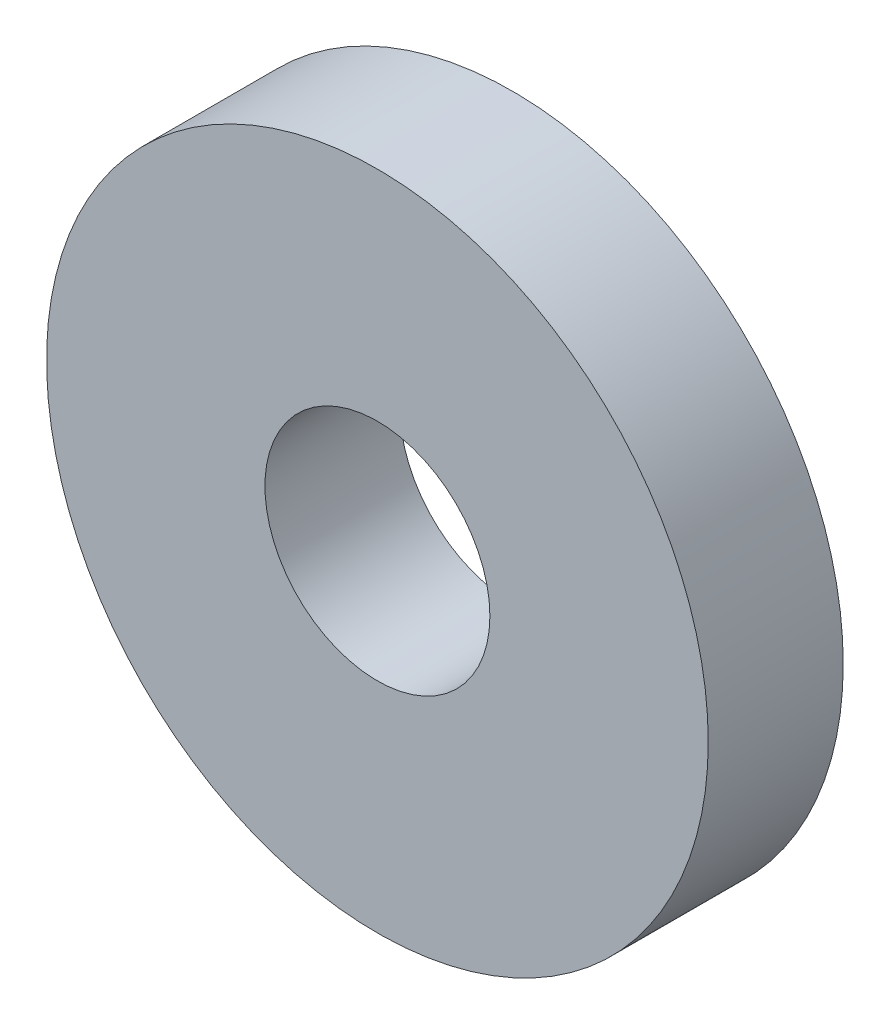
ISO-10303-21;
HEADER;
FILE_DESCRIPTION(('STEP AP214'),'2;1');
FILE_NAME('part.step','',(''),(''),'','','');
FILE_SCHEMA(('AUTOMOTIVE_DESIGN { 1 0 10303 214 1 1 1 1 }'));
ENDSEC;
DATA;
#1=APPLICATION_CONTEXT('core data for automotive mechanical design processes');
#2=APPLICATION_PROTOCOL_DEFINITION('international standard','automotive_design',2000,#1);
#3=PRODUCT_CONTEXT('',#1,'mechanical');
#4=PRODUCT('Part','Part','',(#3));
#5=PRODUCT_RELATED_PRODUCT_CATEGORY('part','',(#4));
#6=PRODUCT_DEFINITION_FORMATION('','',#4);
#7=PRODUCT_DEFINITION_CONTEXT('part definition',#1,'design');
#8=PRODUCT_DEFINITION('design','',#6,#7);
#9=PRODUCT_DEFINITION_SHAPE('','',#8);
#10=(LENGTH_UNIT() NAMED_UNIT(*) SI_UNIT(.MILLI.,.METRE.));
#11=(NAMED_UNIT(*) PLANE_ANGLE_UNIT() SI_UNIT($,.RADIAN.));
#12=(NAMED_UNIT(*) SI_UNIT($,.STERADIAN.) SOLID_ANGLE_UNIT());
#13=UNCERTAINTY_MEASURE_WITH_UNIT(LENGTH_MEASURE(1.E-05),#10,'distance_accuracy_value','');
#14=(GEOMETRIC_REPRESENTATION_CONTEXT(3) GLOBAL_UNCERTAINTY_ASSIGNED_CONTEXT((#13)) GLOBAL_UNIT_ASSIGNED_CONTEXT((#10,
#11,#12)) REPRESENTATION_CONTEXT('',''));
#15=CARTESIAN_POINT('',(0.,0.,0.));
#16=DIRECTION('',(0.,0.,1.));
#17=DIRECTION('',(1.,0.,0.));
#18=AXIS2_PLACEMENT_3D('',#15,#16,#17);
#19=CARTESIAN_POINT('',(0.,0.,5.1));
#20=DIRECTION('',(0.,0.,-1.));
#21=DIRECTION('',(-1.,0.,0.));
#22=AXIS2_PLACEMENT_3D('',#19,#20,#21);
#23=CYLINDRICAL_SURFACE('',#22,4.25);
#24=CARTESIAN_POINT('',(0.,0.,5.1));
#25=DIRECTION('',(0.,0.,1.));
#26=DIRECTION('',(1.,0.,0.));
#27=AXIS2_PLACEMENT_3D('',#24,#25,#26);
#28=CIRCLE('',#27,4.25);
#29=CARTESIAN_POINT('',(4.25,0.,5.1));
#30=VERTEX_POINT('',#29);
#31=EDGE_CURVE('E42',#30,#30,#28,.T.);
#32=ORIENTED_EDGE('',*,*,#31,.T.);
#33=EDGE_LOOP('',(#32));
#34=FACE_BOUND('',#33,.T.);
#35=CARTESIAN_POINT('',(0.,0.,0.));
#36=DIRECTION('',(0.,0.,1.));
#37=DIRECTION('',(1.,0.,0.));
#38=AXIS2_PLACEMENT_3D('',#35,#36,#37);
#39=CIRCLE('',#38,4.25);
#40=CARTESIAN_POINT('',(4.25,0.,0.));
#41=VERTEX_POINT('',#40);
#42=EDGE_CURVE('E48',#41,#41,#39,.T.);
#43=ORIENTED_EDGE('',*,*,#42,.F.);
#44=EDGE_LOOP('',(#43));
#45=FACE_BOUND('',#44,.T.);
#46=ADVANCED_FACE('F34',(#34,#45),#23,.F.);
#47=CARTESIAN_POINT('',(0.,0.,5.1));
#48=DIRECTION('',(0.,0.,-1.));
#49=DIRECTION('',(-1.,0.,0.));
#50=AXIS2_PLACEMENT_3D('',#47,#48,#49);
#51=CYLINDRICAL_SURFACE('',#50,12.5);
#52=CARTESIAN_POINT('',(0.,0.,5.1));
#53=DIRECTION('',(0.,0.,1.));
#54=DIRECTION('',(1.,0.,0.));
#55=AXIS2_PLACEMENT_3D('',#52,#53,#54);
#56=CIRCLE('',#55,12.5);
#57=CARTESIAN_POINT('',(12.5,0.,5.1));
#58=VERTEX_POINT('',#57);
#59=EDGE_CURVE('E10',#58,#58,#56,.T.);
#60=ORIENTED_EDGE('',*,*,#59,.F.);
#61=EDGE_LOOP('',(#60));
#62=FACE_BOUND('',#61,.T.);
#63=CARTESIAN_POINT('',(0.,0.,0.));
#64=DIRECTION('',(0.,0.,1.));
#65=DIRECTION('',(1.,0.,0.));
#66=AXIS2_PLACEMENT_3D('',#63,#64,#65);
#67=CIRCLE('',#66,12.5);
#68=CARTESIAN_POINT('',(12.5,0.,0.));
#69=VERTEX_POINT('',#68);
#70=EDGE_CURVE('E37',#69,#69,#67,.T.);
#71=ORIENTED_EDGE('',*,*,#70,.T.);
#72=EDGE_LOOP('',(#71));
#73=FACE_BOUND('',#72,.T.);
#74=ADVANCED_FACE('F55',(#62,#73),#51,.T.);
#75=CARTESIAN_POINT('',(0.,0.,5.1));
#76=DIRECTION('',(0.,0.,1.));
#77=DIRECTION('',(1.,0.,0.));
#78=AXIS2_PLACEMENT_3D('',#75,#76,#77);
#79=PLANE('',#78);
#80=ORIENTED_EDGE('',*,*,#31,.F.);
#81=EDGE_LOOP('',(#80));
#82=FACE_BOUND('',#81,.T.);
#83=ORIENTED_EDGE('',*,*,#59,.T.);
#84=EDGE_LOOP('',(#83));
#85=FACE_BOUND('',#84,.T.);
#86=ADVANCED_FACE('F59',(#82,#85),#79,.T.);
#87=CARTESIAN_POINT('',(0.,0.,0.));
#88=DIRECTION('',(0.,0.,1.));
#89=DIRECTION('',(1.,0.,0.));
#90=AXIS2_PLACEMENT_3D('',#87,#88,#89);
#91=PLANE('',#90);
#92=ORIENTED_EDGE('',*,*,#42,.T.);
#93=EDGE_LOOP('',(#92));
#94=FACE_BOUND('',#93,.T.);
#95=ORIENTED_EDGE('',*,*,#70,.F.);
#96=EDGE_LOOP('',(#95));
#97=FACE_BOUND('',#96,.T.);
#98=ADVANCED_FACE('F57',(#94,#97),#91,.F.);
#99=CLOSED_SHELL('',(#46,#74,#86,#98));
#100=MANIFOLD_SOLID_BREP('B2',#99);
#101=ADVANCED_BREP_SHAPE_REPRESENTATION('',(#18,#100),#14);
#102=SHAPE_DEFINITION_REPRESENTATION(#9,#101);
ENDSEC;
END-ISO-10303-21;
